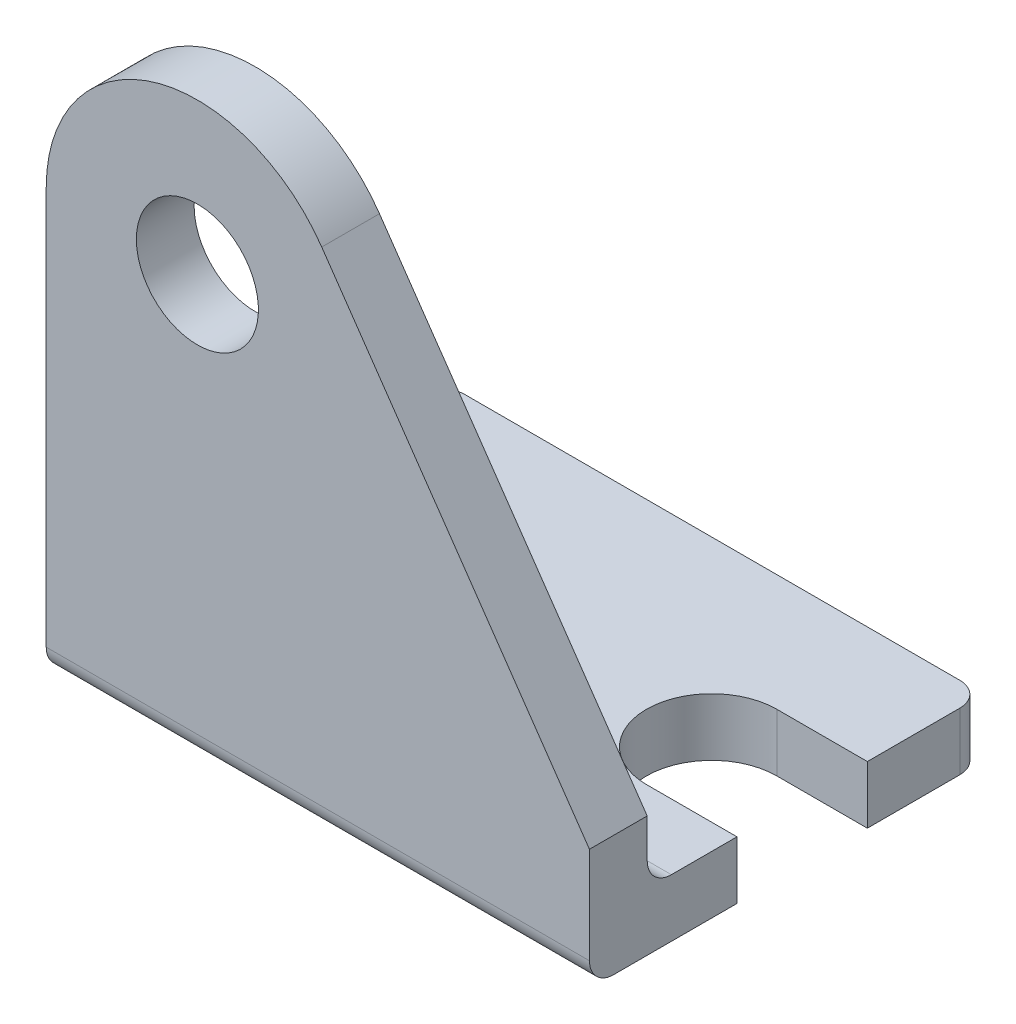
ISO-10303-21;
HEADER;
FILE_DESCRIPTION(('STEP AP214'),'2;1');
FILE_NAME('part.step','',(''),(''),'','','');
FILE_SCHEMA(('AUTOMOTIVE_DESIGN { 1 0 10303 214 1 1 1 1 }'));
ENDSEC;
DATA;
#1=APPLICATION_CONTEXT('core data for automotive mechanical design processes');
#2=APPLICATION_PROTOCOL_DEFINITION('international standard','automotive_design',2000,#1);
#3=PRODUCT_CONTEXT('',#1,'mechanical');
#4=PRODUCT('Part','Part','',(#3));
#5=PRODUCT_RELATED_PRODUCT_CATEGORY('part','',(#4));
#6=PRODUCT_DEFINITION_FORMATION('','',#4);
#7=PRODUCT_DEFINITION_CONTEXT('part definition',#1,'design');
#8=PRODUCT_DEFINITION('design','',#6,#7);
#9=PRODUCT_DEFINITION_SHAPE('','',#8);
#10=(LENGTH_UNIT() NAMED_UNIT(*) SI_UNIT(.MILLI.,.METRE.));
#11=(NAMED_UNIT(*) PLANE_ANGLE_UNIT() SI_UNIT($,.RADIAN.));
#12=(NAMED_UNIT(*) SI_UNIT($,.STERADIAN.) SOLID_ANGLE_UNIT());
#13=UNCERTAINTY_MEASURE_WITH_UNIT(LENGTH_MEASURE(1.E-05),#10,'distance_accuracy_value','');
#14=(GEOMETRIC_REPRESENTATION_CONTEXT(3) GLOBAL_UNCERTAINTY_ASSIGNED_CONTEXT((#13)) GLOBAL_UNIT_ASSIGNED_CONTEXT((#10,
#11,#12)) REPRESENTATION_CONTEXT('',''));
#15=CARTESIAN_POINT('',(0.,0.,0.));
#16=DIRECTION('',(0.,0.,1.));
#17=DIRECTION('',(1.,0.,0.));
#18=AXIS2_PLACEMENT_3D('',#15,#16,#17);
#19=CARTESIAN_POINT('',(4.7625,3.03784,-14.6177));
#20=DIRECTION('',(0.,0.,1.));
#21=DIRECTION('',(1.,0.,0.));
#22=AXIS2_PLACEMENT_3D('',#19,#20,#21);
#23=PLANE('',#22);
#24=DIRECTION('',(1.,0.,0.));
#25=VECTOR('',#24,1.);
#26=CARTESIAN_POINT('',(28.575,3.03784,-14.6177));
#27=LINE('',#26,#25);
#28=CARTESIAN_POINT('',(4.7625,3.03784,-14.6177));
#29=VERTEX_POINT('',#28);
#30=CARTESIAN_POINT('',(0.,3.03784,-14.6177));
#31=VERTEX_POINT('',#30);
#32=EDGE_CURVE('E248',#29,#31,#27,.F.);
#33=ORIENTED_EDGE('',*,*,#32,.T.);
#34=DIRECTION('',(0.,1.,0.));
#35=VECTOR('',#34,1.);
#36=CARTESIAN_POINT('',(0.,1.27000000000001,-14.6177));
#37=LINE('',#36,#35);
#38=CARTESIAN_POINT('',(0.,0.,-14.6177));
#39=VERTEX_POINT('',#38);
#40=EDGE_CURVE('E183',#31,#39,#37,.F.);
#41=ORIENTED_EDGE('',*,*,#40,.T.);
#42=DIRECTION('',(1.,0.,0.));
#43=VECTOR('',#42,1.);
#44=CARTESIAN_POINT('',(28.575,0.,-14.6177));
#45=LINE('',#44,#43);
#46=CARTESIAN_POINT('',(4.7625,0.,-14.6177));
#47=VERTEX_POINT('',#46);
#48=EDGE_CURVE('E240',#39,#47,#45,.T.);
#49=ORIENTED_EDGE('',*,*,#48,.T.);
#50=DIRECTION('',(0.,1.,0.));
#51=VECTOR('',#50,1.);
#52=CARTESIAN_POINT('',(4.7625,3.03784,-14.6177));
#53=LINE('',#52,#51);
#54=EDGE_CURVE('E182',#47,#29,#53,.T.);
#55=ORIENTED_EDGE('',*,*,#54,.T.);
#56=EDGE_LOOP('',(#33,#41,#49,#55));
#57=FACE_BOUND('',#56,.T.);
#58=ADVANCED_FACE('F17',(#57),#23,.T.);
#59=CARTESIAN_POINT('',(23.8125,3.03784,-11.1887));
#60=DIRECTION('',(0.,1.,0.));
#61=DIRECTION('',(0.,0.,1.));
#62=AXIS2_PLACEMENT_3D('',#59,#60,#61);
#63=CYLINDRICAL_SURFACE('',#62,3.429);
#64=DIRECTION('',(0.,1.,0.));
#65=VECTOR('',#64,1.);
#66=CARTESIAN_POINT('',(23.8125,3.03784,-7.7597));
#67=LINE('',#66,#65);
#68=CARTESIAN_POINT('',(23.8125,0.,-7.7597));
#69=VERTEX_POINT('',#68);
#70=CARTESIAN_POINT('',(23.8125,3.03784,-7.7597));
#71=VERTEX_POINT('',#70);
#72=EDGE_CURVE('E157',#69,#71,#67,.T.);
#73=ORIENTED_EDGE('',*,*,#72,.F.);
#74=CARTESIAN_POINT('',(23.8125,0.,-11.1887));
#75=DIRECTION('',(0.,1.,0.));
#76=DIRECTION('',(0.,0.,1.));
#77=AXIS2_PLACEMENT_3D('',#74,#75,#76);
#78=CIRCLE('',#77,3.429);
#79=CARTESIAN_POINT('',(23.8125,0.,-14.6177));
#80=VERTEX_POINT('',#79);
#81=EDGE_CURVE('E234',#69,#80,#78,.F.);
#82=ORIENTED_EDGE('',*,*,#81,.T.);
#83=DIRECTION('',(0.,1.,0.));
#84=VECTOR('',#83,1.);
#85=CARTESIAN_POINT('',(23.8125,3.03784,-14.6177));
#86=LINE('',#85,#84);
#87=CARTESIAN_POINT('',(23.8125,3.03784,-14.6177));
#88=VERTEX_POINT('',#87);
#89=EDGE_CURVE('E145',#88,#80,#86,.F.);
#90=ORIENTED_EDGE('',*,*,#89,.F.);
#91=CARTESIAN_POINT('',(23.8125,3.03784,-11.1887));
#92=DIRECTION('',(0.,1.,0.));
#93=DIRECTION('',(0.,0.,1.));
#94=AXIS2_PLACEMENT_3D('',#91,#92,#93);
#95=CIRCLE('',#94,3.429);
#96=EDGE_CURVE('E153',#88,#71,#95,.T.);
#97=ORIENTED_EDGE('',*,*,#96,.T.);
#98=EDGE_LOOP('',(#73,#82,#90,#97));
#99=FACE_BOUND('',#98,.T.);
#100=ADVANCED_FACE('F436',(#99),#63,.F.);
#101=CARTESIAN_POINT('',(28.575,3.03784,-14.6177));
#102=DIRECTION('',(0.,0.,1.));
#103=DIRECTION('',(1.,0.,0.));
#104=AXIS2_PLACEMENT_3D('',#101,#102,#103);
#105=PLANE('',#104);
#106=DIRECTION('',(1.,0.,0.));
#107=VECTOR('',#106,1.);
#108=CARTESIAN_POINT('',(28.575,3.03784,-14.6177));
#109=LINE('',#108,#107);
#110=CARTESIAN_POINT('',(28.575,3.03784,-14.6177));
#111=VERTEX_POINT('',#110);
#112=EDGE_CURVE('E141',#111,#88,#109,.F.);
#113=ORIENTED_EDGE('',*,*,#112,.T.);
#114=ORIENTED_EDGE('',*,*,#89,.T.);
#115=DIRECTION('',(1.,0.,0.));
#116=VECTOR('',#115,1.);
#117=CARTESIAN_POINT('',(28.575,0.,-14.6177));
#118=LINE('',#117,#116);
#119=CARTESIAN_POINT('',(28.575,0.,-14.6177));
#120=VERTEX_POINT('',#119);
#121=EDGE_CURVE('E143',#80,#120,#118,.T.);
#122=ORIENTED_EDGE('',*,*,#121,.T.);
#123=DIRECTION('',(0.,1.,0.));
#124=VECTOR('',#123,1.);
#125=CARTESIAN_POINT('',(28.575,1.27000000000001,-14.6177));
#126=LINE('',#125,#124);
#127=EDGE_CURVE('E138',#111,#120,#126,.F.);
#128=ORIENTED_EDGE('',*,*,#127,.F.);
#129=EDGE_LOOP('',(#113,#114,#122,#128));
#130=FACE_BOUND('',#129,.T.);
#131=ADVANCED_FACE('F140',(#130),#105,.T.);
#132=CARTESIAN_POINT('',(28.575,1.27000000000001,-1.27));
#133=DIRECTION('',(1.,0.,0.));
#134=DIRECTION('',(0.,0.,-1.));
#135=AXIS2_PLACEMENT_3D('',#132,#133,#134);
#136=PLANE('',#135);
#137=DIRECTION('',(0.,0.,-1.));
#138=VECTOR('',#137,1.);
#139=CARTESIAN_POINT('',(28.575,3.03784,-20.7518));
#140=LINE('',#139,#138);
#141=CARTESIAN_POINT('',(28.575,3.03784,-19.4818));
#142=VERTEX_POINT('',#141);
#143=EDGE_CURVE('E150',#142,#111,#140,.F.);
#144=ORIENTED_EDGE('',*,*,#143,.T.);
#145=ORIENTED_EDGE('',*,*,#127,.T.);
#146=DIRECTION('',(0.,0.,1.));
#147=VECTOR('',#146,1.);
#148=CARTESIAN_POINT('',(28.575,0.,-1.27));
#149=LINE('',#148,#147);
#150=CARTESIAN_POINT('',(28.575,0.,-19.4818));
#151=VERTEX_POINT('',#150);
#152=EDGE_CURVE('E233',#120,#151,#149,.F.);
#153=ORIENTED_EDGE('',*,*,#152,.T.);
#154=DIRECTION('',(0.,1.,0.));
#155=VECTOR('',#154,1.);
#156=CARTESIAN_POINT('',(28.575,3.03784,-19.4818));
#157=LINE('',#156,#155);
#158=EDGE_CURVE('E132',#142,#151,#157,.F.);
#159=ORIENTED_EDGE('',*,*,#158,.F.);
#160=EDGE_LOOP('',(#144,#145,#153,#159));
#161=FACE_BOUND('',#160,.T.);
#162=ADVANCED_FACE('F155',(#161),#136,.T.);
#163=CARTESIAN_POINT('',(27.305,3.03784,-19.4818));
#164=DIRECTION('',(0.,1.,0.));
#165=DIRECTION('',(0.,0.,1.));
#166=AXIS2_PLACEMENT_3D('',#163,#164,#165);
#167=CYLINDRICAL_SURFACE('',#166,1.27000000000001);
#168=CARTESIAN_POINT('',(27.305,3.03784,-19.4818));
#169=DIRECTION('',(0.,1.,0.));
#170=DIRECTION('',(0.,0.,1.));
#171=AXIS2_PLACEMENT_3D('',#168,#169,#170);
#172=CIRCLE('',#171,1.27000000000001);
#173=CARTESIAN_POINT('',(27.305,3.03784,-20.7518));
#174=VERTEX_POINT('',#173);
#175=EDGE_CURVE('E20',#174,#142,#172,.F.);
#176=ORIENTED_EDGE('',*,*,#175,.T.);
#177=ORIENTED_EDGE('',*,*,#158,.T.);
#178=CARTESIAN_POINT('',(27.305,0.,-19.4818));
#179=DIRECTION('',(0.,1.,0.));
#180=DIRECTION('',(0.,0.,1.));
#181=AXIS2_PLACEMENT_3D('',#178,#179,#180);
#182=CIRCLE('',#181,1.27000000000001);
#183=CARTESIAN_POINT('',(27.305,0.,-20.7518));
#184=VERTEX_POINT('',#183);
#185=EDGE_CURVE('E230',#151,#184,#182,.T.);
#186=ORIENTED_EDGE('',*,*,#185,.T.);
#187=DIRECTION('',(0.,1.,0.));
#188=VECTOR('',#187,1.);
#189=CARTESIAN_POINT('',(27.305,0.,-20.7518));
#190=LINE('',#189,#188);
#191=EDGE_CURVE('E190',#184,#174,#190,.T.);
#192=ORIENTED_EDGE('',*,*,#191,.T.);
#193=EDGE_LOOP('',(#176,#177,#186,#192));
#194=FACE_BOUND('',#193,.T.);
#195=ADVANCED_FACE('F428',(#194),#167,.T.);
#196=CARTESIAN_POINT('',(28.575,0.,-20.7518));
#197=DIRECTION('',(0.,0.,1.));
#198=DIRECTION('',(1.,0.,0.));
#199=AXIS2_PLACEMENT_3D('',#196,#197,#198);
#200=PLANE('',#199);
#201=DIRECTION('',(0.,1.,0.));
#202=VECTOR('',#201,1.);
#203=CARTESIAN_POINT('',(1.27,3.03784,-20.7518));
#204=LINE('',#203,#202);
#205=CARTESIAN_POINT('',(1.27,3.03784,-20.7518));
#206=VERTEX_POINT('',#205);
#207=CARTESIAN_POINT('',(1.27,0.,-20.7518));
#208=VERTEX_POINT('',#207);
#209=EDGE_CURVE('E186',#206,#208,#204,.F.);
#210=ORIENTED_EDGE('',*,*,#209,.F.);
#211=DIRECTION('',(1.,0.,0.));
#212=VECTOR('',#211,1.);
#213=CARTESIAN_POINT('',(28.575,3.03784,-20.7518));
#214=LINE('',#213,#212);
#215=EDGE_CURVE('E244',#206,#174,#214,.T.);
#216=ORIENTED_EDGE('',*,*,#215,.T.);
#217=ORIENTED_EDGE('',*,*,#191,.F.);
#218=DIRECTION('',(1.,0.,0.));
#219=VECTOR('',#218,1.);
#220=CARTESIAN_POINT('',(28.575,0.,-20.7518));
#221=LINE('',#220,#219);
#222=EDGE_CURVE('E229',#184,#208,#221,.F.);
#223=ORIENTED_EDGE('',*,*,#222,.T.);
#224=EDGE_LOOP('',(#210,#216,#217,#223));
#225=FACE_BOUND('',#224,.T.);
#226=ADVANCED_FACE('F424',(#225),#200,.F.);
#227=CARTESIAN_POINT('',(1.27,3.03784,-19.4818));
#228=DIRECTION('',(0.,1.,0.));
#229=DIRECTION('',(0.,0.,1.));
#230=AXIS2_PLACEMENT_3D('',#227,#228,#229);
#231=CYLINDRICAL_SURFACE('',#230,1.27);
#232=CARTESIAN_POINT('',(1.27,3.03784,-19.4818));
#233=DIRECTION('',(0.,1.,0.));
#234=DIRECTION('',(0.,0.,1.));
#235=AXIS2_PLACEMENT_3D('',#232,#233,#234);
#236=CIRCLE('',#235,1.27);
#237=CARTESIAN_POINT('',(0.,3.03784,-19.4818));
#238=VERTEX_POINT('',#237);
#239=EDGE_CURVE('E241',#238,#206,#236,.F.);
#240=ORIENTED_EDGE('',*,*,#239,.T.);
#241=ORIENTED_EDGE('',*,*,#209,.T.);
#242=CARTESIAN_POINT('',(1.27,0.,-19.4818));
#243=DIRECTION('',(0.,1.,0.));
#244=DIRECTION('',(0.,0.,1.));
#245=AXIS2_PLACEMENT_3D('',#242,#243,#244);
#246=CIRCLE('',#245,1.27);
#247=CARTESIAN_POINT('',(0.,0.,-19.4818));
#248=VERTEX_POINT('',#247);
#249=EDGE_CURVE('E225',#208,#248,#246,.T.);
#250=ORIENTED_EDGE('',*,*,#249,.T.);
#251=DIRECTION('',(0.,1.,0.));
#252=VECTOR('',#251,1.);
#253=CARTESIAN_POINT('',(0.,1.27000000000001,-19.4818));
#254=LINE('',#253,#252);
#255=EDGE_CURVE('E180',#248,#238,#254,.T.);
#256=ORIENTED_EDGE('',*,*,#255,.T.);
#257=EDGE_LOOP('',(#240,#241,#250,#256));
#258=FACE_BOUND('',#257,.T.);
#259=ADVANCED_FACE('F420',(#258),#231,.T.);
#260=CARTESIAN_POINT('',(0.,1.27000000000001,-1.27));
#261=DIRECTION('',(1.,0.,0.));
#262=DIRECTION('',(0.,0.,-1.));
#263=AXIS2_PLACEMENT_3D('',#260,#261,#262);
#264=PLANE('',#263);
#265=DIRECTION('',(0.,0.,1.));
#266=VECTOR('',#265,1.);
#267=CARTESIAN_POINT('',(0.,0.,-1.27));
#268=LINE('',#267,#266);
#269=EDGE_CURVE('E228',#248,#39,#268,.T.);
#270=ORIENTED_EDGE('',*,*,#269,.T.);
#271=ORIENTED_EDGE('',*,*,#40,.F.);
#272=DIRECTION('',(0.,0.,-1.));
#273=VECTOR('',#272,1.);
#274=CARTESIAN_POINT('',(0.,3.03784,-20.7518));
#275=LINE('',#274,#273);
#276=EDGE_CURVE('E245',#31,#238,#275,.T.);
#277=ORIENTED_EDGE('',*,*,#276,.T.);
#278=ORIENTED_EDGE('',*,*,#255,.F.);
#279=EDGE_LOOP('',(#270,#271,#277,#278));
#280=FACE_BOUND('',#279,.T.);
#281=ADVANCED_FACE('F416',(#280),#264,.F.);
#282=CARTESIAN_POINT('',(4.7625,3.03784,-11.1887));
#283=DIRECTION('',(0.,1.,0.));
#284=DIRECTION('',(0.,0.,1.));
#285=AXIS2_PLACEMENT_3D('',#282,#283,#284);
#286=CYLINDRICAL_SURFACE('',#285,3.429);
#287=DIRECTION('',(0.,1.,0.));
#288=VECTOR('',#287,1.);
#289=CARTESIAN_POINT('',(4.7625,3.03784,-7.7597));
#290=LINE('',#289,#288);
#291=CARTESIAN_POINT('',(4.7625,3.03784,-7.7597));
#292=VERTEX_POINT('',#291);
#293=CARTESIAN_POINT('',(4.7625,0.,-7.7597));
#294=VERTEX_POINT('',#293);
#295=EDGE_CURVE('E166',#292,#294,#290,.F.);
#296=ORIENTED_EDGE('',*,*,#295,.F.);
#297=CARTESIAN_POINT('',(4.7625,3.03784,-11.1887));
#298=DIRECTION('',(0.,1.,0.));
#299=DIRECTION('',(0.,0.,1.));
#300=AXIS2_PLACEMENT_3D('',#297,#298,#299);
#301=CIRCLE('',#300,3.429);
#302=EDGE_CURVE('E246',#292,#29,#301,.T.);
#303=ORIENTED_EDGE('',*,*,#302,.T.);
#304=ORIENTED_EDGE('',*,*,#54,.F.);
#305=CARTESIAN_POINT('',(4.7625,0.,-11.1887));
#306=DIRECTION('',(0.,1.,0.));
#307=DIRECTION('',(0.,0.,1.));
#308=AXIS2_PLACEMENT_3D('',#305,#306,#307);
#309=CIRCLE('',#308,3.429);
#310=EDGE_CURVE('E238',#47,#294,#309,.F.);
#311=ORIENTED_EDGE('',*,*,#310,.T.);
#312=EDGE_LOOP('',(#296,#303,#304,#311));
#313=FACE_BOUND('',#312,.T.);
#314=ADVANCED_FACE('F413',(#313),#286,.F.);
#315=CARTESIAN_POINT('',(23.8125,3.03784,-7.7597));
#316=DIRECTION('',(0.,0.,-1.));
#317=DIRECTION('',(-1.,0.,0.));
#318=AXIS2_PLACEMENT_3D('',#315,#316,#317);
#319=PLANE('',#318);
#320=DIRECTION('',(1.,0.,0.));
#321=VECTOR('',#320,1.);
#322=CARTESIAN_POINT('',(28.575,3.03784,-7.7597));
#323=LINE('',#322,#321);
#324=CARTESIAN_POINT('',(28.575,3.03784,-7.7597));
#325=VERTEX_POINT('',#324);
#326=EDGE_CURVE('E249',#71,#325,#323,.T.);
#327=ORIENTED_EDGE('',*,*,#326,.T.);
#328=DIRECTION('',(0.,1.,0.));
#329=VECTOR('',#328,1.);
#330=CARTESIAN_POINT('',(28.575,1.27000000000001,-7.7597));
#331=LINE('',#330,#329);
#332=CARTESIAN_POINT('',(28.575,0.,-7.7597));
#333=VERTEX_POINT('',#332);
#334=EDGE_CURVE('E170',#333,#325,#331,.T.);
#335=ORIENTED_EDGE('',*,*,#334,.F.);
#336=DIRECTION('',(1.,0.,0.));
#337=VECTOR('',#336,1.);
#338=CARTESIAN_POINT('',(28.575,0.,-7.7597));
#339=LINE('',#338,#337);
#340=EDGE_CURVE('E237',#333,#69,#339,.F.);
#341=ORIENTED_EDGE('',*,*,#340,.T.);
#342=ORIENTED_EDGE('',*,*,#72,.T.);
#343=EDGE_LOOP('',(#327,#335,#341,#342));
#344=FACE_BOUND('',#343,.T.);
#345=ADVANCED_FACE('F410',(#344),#319,.T.);
#346=CARTESIAN_POINT('',(28.575,3.03784,-20.7518));
#347=DIRECTION('',(0.,-1.,0.));
#348=DIRECTION('',(0.,0.,-1.));
#349=AXIS2_PLACEMENT_3D('',#346,#347,#348);
#350=PLANE('',#349);
#351=ORIENTED_EDGE('',*,*,#239,.F.);
#352=ORIENTED_EDGE('',*,*,#276,.F.);
#353=ORIENTED_EDGE('',*,*,#32,.F.);
#354=ORIENTED_EDGE('',*,*,#302,.F.);
#355=DIRECTION('',(-1.,0.,0.));
#356=VECTOR('',#355,1.);
#357=CARTESIAN_POINT('',(0.,3.03784,-7.7597));
#358=LINE('',#357,#356);
#359=CARTESIAN_POINT('',(0.,3.03784,-7.7597));
#360=VERTEX_POINT('',#359);
#361=EDGE_CURVE('E163',#360,#292,#358,.F.);
#362=ORIENTED_EDGE('',*,*,#361,.F.);
#363=DIRECTION('',(0.,0.,-1.));
#364=VECTOR('',#363,1.);
#365=CARTESIAN_POINT('',(0.,3.03784,-1.27));
#366=LINE('',#365,#364);
#367=CARTESIAN_POINT('',(0.,3.03784,-4.30784));
#368=VERTEX_POINT('',#367);
#369=EDGE_CURVE('E214',#360,#368,#366,.F.);
#370=ORIENTED_EDGE('',*,*,#369,.T.);
#371=DIRECTION('',(1.,0.,0.));
#372=VECTOR('',#371,1.);
#373=CARTESIAN_POINT('',(28.575,3.03784,-4.30784));
#374=LINE('',#373,#372);
#375=CARTESIAN_POINT('',(28.575,3.03784,-4.30784));
#376=VERTEX_POINT('',#375);
#377=EDGE_CURVE('E269',#368,#376,#374,.T.);
#378=ORIENTED_EDGE('',*,*,#377,.T.);
#379=DIRECTION('',(0.,0.,-1.));
#380=VECTOR('',#379,1.);
#381=CARTESIAN_POINT('',(28.575,3.03784,-1.27));
#382=LINE('',#381,#380);
#383=EDGE_CURVE('E173',#325,#376,#382,.F.);
#384=ORIENTED_EDGE('',*,*,#383,.F.);
#385=ORIENTED_EDGE('',*,*,#326,.F.);
#386=ORIENTED_EDGE('',*,*,#96,.F.);
#387=ORIENTED_EDGE('',*,*,#112,.F.);
#388=ORIENTED_EDGE('',*,*,#143,.F.);
#389=ORIENTED_EDGE('',*,*,#175,.F.);
#390=ORIENTED_EDGE('',*,*,#215,.F.);
#391=EDGE_LOOP('',(#351,#352,#353,#354,#362,#370,#378,#384,#385,#386,#387,#388,#389,#390));
#392=FACE_BOUND('',#391,.T.);
#393=ADVANCED_FACE('F149',(#392),#350,.F.);
#394=CARTESIAN_POINT('',(28.575,4.30784,-4.30784));
#395=DIRECTION('',(1.,0.,0.));
#396=DIRECTION('',(0.,0.,-1.));
#397=AXIS2_PLACEMENT_3D('',#394,#395,#396);
#398=CYLINDRICAL_SURFACE('',#397,1.27);
#399=DIRECTION('',(1.,0.,0.));
#400=VECTOR('',#399,1.);
#401=CARTESIAN_POINT('',(28.575,4.30784,-3.03784));
#402=LINE('',#401,#400);
#403=CARTESIAN_POINT('',(0.,4.30784,-3.03784));
#404=VERTEX_POINT('',#403);
#405=CARTESIAN_POINT('',(28.575,4.30784,-3.03784));
#406=VERTEX_POINT('',#405);
#407=EDGE_CURVE('E179',#404,#406,#402,.T.);
#408=ORIENTED_EDGE('',*,*,#407,.T.);
#409=CARTESIAN_POINT('',(28.575,4.30784,-4.30784));
#410=DIRECTION('',(1.,0.,0.));
#411=DIRECTION('',(0.,0.,-1.));
#412=AXIS2_PLACEMENT_3D('',#409,#410,#411);
#413=CIRCLE('',#412,1.27);
#414=EDGE_CURVE('E218',#376,#406,#413,.F.);
#415=ORIENTED_EDGE('',*,*,#414,.F.);
#416=ORIENTED_EDGE('',*,*,#377,.F.);
#417=CARTESIAN_POINT('',(0.,4.30784,-4.30784));
#418=DIRECTION('',(1.,0.,0.));
#419=DIRECTION('',(0.,0.,-1.));
#420=AXIS2_PLACEMENT_3D('',#417,#418,#419);
#421=CIRCLE('',#420,1.27);
#422=EDGE_CURVE('E211',#368,#404,#421,.F.);
#423=ORIENTED_EDGE('',*,*,#422,.T.);
#424=EDGE_LOOP('',(#408,#415,#416,#423));
#425=FACE_BOUND('',#424,.T.);
#426=ADVANCED_FACE('F403',(#425),#398,.F.);
#427=CARTESIAN_POINT('',(28.575,0.,-1.27));
#428=DIRECTION('',(0.,1.,0.));
#429=DIRECTION('',(0.,0.,1.));
#430=AXIS2_PLACEMENT_3D('',#427,#428,#429);
#431=PLANE('',#430);
#432=ORIENTED_EDGE('',*,*,#249,.F.);
#433=ORIENTED_EDGE('',*,*,#222,.F.);
#434=ORIENTED_EDGE('',*,*,#185,.F.);
#435=ORIENTED_EDGE('',*,*,#152,.F.);
#436=ORIENTED_EDGE('',*,*,#121,.F.);
#437=ORIENTED_EDGE('',*,*,#81,.F.);
#438=ORIENTED_EDGE('',*,*,#340,.F.);
#439=DIRECTION('',(0.,0.,-1.));
#440=VECTOR('',#439,1.);
#441=CARTESIAN_POINT('',(28.575,0.,-1.27));
#442=LINE('',#441,#440);
#443=CARTESIAN_POINT('',(28.575,0.,-1.27));
#444=VERTEX_POINT('',#443);
#445=EDGE_CURVE('E174',#444,#333,#442,.T.);
#446=ORIENTED_EDGE('',*,*,#445,.F.);
#447=DIRECTION('',(1.,0.,0.));
#448=VECTOR('',#447,1.);
#449=CARTESIAN_POINT('',(28.575,0.,-1.27));
#450=LINE('',#449,#448);
#451=CARTESIAN_POINT('',(0.,0.,-1.27));
#452=VERTEX_POINT('',#451);
#453=EDGE_CURVE('E217',#452,#444,#450,.T.);
#454=ORIENTED_EDGE('',*,*,#453,.F.);
#455=DIRECTION('',(0.,0.,-1.));
#456=VECTOR('',#455,1.);
#457=CARTESIAN_POINT('',(0.,0.,-1.27));
#458=LINE('',#457,#456);
#459=CARTESIAN_POINT('',(0.,0.,-7.7597));
#460=VERTEX_POINT('',#459);
#461=EDGE_CURVE('E209',#452,#460,#458,.T.);
#462=ORIENTED_EDGE('',*,*,#461,.T.);
#463=DIRECTION('',(-1.,0.,0.));
#464=VECTOR('',#463,1.);
#465=CARTESIAN_POINT('',(0.,0.,-7.7597));
#466=LINE('',#465,#464);
#467=EDGE_CURVE('E167',#294,#460,#466,.T.);
#468=ORIENTED_EDGE('',*,*,#467,.F.);
#469=ORIENTED_EDGE('',*,*,#310,.F.);
#470=ORIENTED_EDGE('',*,*,#48,.F.);
#471=ORIENTED_EDGE('',*,*,#269,.F.);
#472=EDGE_LOOP('',(#432,#433,#434,#435,#436,#437,#438,#446,#454,#462,#468,#469,#470,#471));
#473=FACE_BOUND('',#472,.T.);
#474=ADVANCED_FACE('F399',(#473),#431,.F.);
#475=CARTESIAN_POINT('',(0.,3.03784,-7.7597));
#476=DIRECTION('',(0.,0.,-1.));
#477=DIRECTION('',(-1.,0.,0.));
#478=AXIS2_PLACEMENT_3D('',#475,#476,#477);
#479=PLANE('',#478);
#480=ORIENTED_EDGE('',*,*,#361,.T.);
#481=ORIENTED_EDGE('',*,*,#295,.T.);
#482=ORIENTED_EDGE('',*,*,#467,.T.);
#483=DIRECTION('',(0.,1.,0.));
#484=VECTOR('',#483,1.);
#485=CARTESIAN_POINT('',(0.,1.27000000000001,-7.7597));
#486=LINE('',#485,#484);
#487=EDGE_CURVE('E205',#460,#360,#486,.T.);
#488=ORIENTED_EDGE('',*,*,#487,.T.);
#489=EDGE_LOOP('',(#480,#481,#482,#488));
#490=FACE_BOUND('',#489,.T.);
#491=ADVANCED_FACE('F395',(#490),#479,.T.);
#492=CARTESIAN_POINT('',(28.575,4.30784,-3.03784));
#493=DIRECTION('',(0.,0.,1.));
#494=DIRECTION('',(1.,0.,0.));
#495=AXIS2_PLACEMENT_3D('',#492,#493,#494);
#496=PLANE('',#495);
#497=DIRECTION('',(-0.568252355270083,0.822854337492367,0.));
#498=VECTOR('',#497,1.);
#499=CARTESIAN_POINT('',(28.575,6.35,-3.03784));
#500=LINE('',#499,#498);
#501=CARTESIAN_POINT('',(28.575,6.35,-3.03784));
#502=VERTEX_POINT('',#501);
#503=CARTESIAN_POINT('',(14.4920565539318,26.7427198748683,-3.03784));
#504=VERTEX_POINT('',#503);
#505=EDGE_CURVE('E224',#502,#504,#500,.T.);
#506=ORIENTED_EDGE('',*,*,#505,.F.);
#507=DIRECTION('',(0.,1.,0.));
#508=VECTOR('',#507,1.);
#509=CARTESIAN_POINT('',(28.575,1.27000000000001,-3.03784));
#510=LINE('',#509,#508);
#511=EDGE_CURVE('E220',#406,#502,#510,.T.);
#512=ORIENTED_EDGE('',*,*,#511,.F.);
#513=ORIENTED_EDGE('',*,*,#407,.F.);
#514=DIRECTION('',(0.,1.,0.));
#515=VECTOR('',#514,1.);
#516=CARTESIAN_POINT('',(0.,1.27000000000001,-3.03784));
#517=LINE('',#516,#515);
#518=CARTESIAN_POINT('',(0.,22.225,-3.03784));
#519=VERTEX_POINT('',#518);
#520=EDGE_CURVE('E210',#404,#519,#517,.T.);
#521=ORIENTED_EDGE('',*,*,#520,.T.);
#522=CARTESIAN_POINT('',(7.9502,22.225,-3.03784));
#523=DIRECTION('',(0.,0.,-1.));
#524=DIRECTION('',(-1.,0.,0.));
#525=AXIS2_PLACEMENT_3D('',#522,#523,#524);
#526=CIRCLE('',#525,7.9502);
#527=EDGE_CURVE('E203',#504,#519,#526,.F.);
#528=ORIENTED_EDGE('',*,*,#527,.F.);
#529=EDGE_LOOP('',(#506,#512,#513,#521,#528));
#530=FACE_BOUND('',#529,.T.);
#531=CARTESIAN_POINT('',(7.9502,22.225,-3.03784));
#532=DIRECTION('',(0.,0.,-1.));
#533=DIRECTION('',(-1.,0.,0.));
#534=AXIS2_PLACEMENT_3D('',#531,#532,#533);
#535=CIRCLE('',#534,3.209925);
#536=CARTESIAN_POINT('',(4.740275,22.225,-3.03784));
#537=VERTEX_POINT('',#536);
#538=EDGE_CURVE('E221',#537,#537,#535,.F.);
#539=ORIENTED_EDGE('',*,*,#538,.T.);
#540=EDGE_LOOP('',(#539));
#541=FACE_BOUND('',#540,.T.);
#542=ADVANCED_FACE('F391',(#530,#541),#496,.F.);
#543=CARTESIAN_POINT('',(7.9502,22.225,-3.03784));
#544=DIRECTION('',(0.,0.,-1.));
#545=DIRECTION('',(-1.,0.,0.));
#546=AXIS2_PLACEMENT_3D('',#543,#544,#545);
#547=CYLINDRICAL_SURFACE('',#546,3.209925);
#548=CARTESIAN_POINT('',(7.9502,22.225,0.));
#549=DIRECTION('',(0.,0.,-1.));
#550=DIRECTION('',(-1.,0.,0.));
#551=AXIS2_PLACEMENT_3D('',#548,#549,#550);
#552=CIRCLE('',#551,3.209925);
#553=CARTESIAN_POINT('',(4.740275,22.225,0.));
#554=VERTEX_POINT('',#553);
#555=EDGE_CURVE('E198',#554,#554,#552,.F.);
#556=ORIENTED_EDGE('',*,*,#555,.T.);
#557=EDGE_LOOP('',(#556));
#558=FACE_BOUND('',#557,.T.);
#559=ORIENTED_EDGE('',*,*,#538,.F.);
#560=EDGE_LOOP('',(#559));
#561=FACE_BOUND('',#560,.T.);
#562=ADVANCED_FACE('F388',(#558,#561),#547,.F.);
#563=CARTESIAN_POINT('',(28.575,6.35,-20.7518));
#564=DIRECTION('',(0.822854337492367,0.568252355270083,0.));
#565=DIRECTION('',(-0.568252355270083,0.822854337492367,0.));
#566=AXIS2_PLACEMENT_3D('',#563,#564,#565);
#567=PLANE('',#566);
#568=DIRECTION('',(0.568252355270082,-0.822854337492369,0.));
#569=VECTOR('',#568,1.);
#570=CARTESIAN_POINT('',(14.4920565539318,26.7427198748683,0.));
#571=LINE('',#570,#569);
#572=CARTESIAN_POINT('',(14.4920565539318,26.7427198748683,0.));
#573=VERTEX_POINT('',#572);
#574=CARTESIAN_POINT('',(28.575,6.35,0.));
#575=VERTEX_POINT('',#574);
#576=EDGE_CURVE('E201',#573,#575,#571,.T.);
#577=ORIENTED_EDGE('',*,*,#576,.T.);
#578=DIRECTION('',(0.,0.,-1.));
#579=VECTOR('',#578,1.);
#580=CARTESIAN_POINT('',(28.575,6.35,-1.27));
#581=LINE('',#580,#579);
#582=EDGE_CURVE('E275',#502,#575,#581,.F.);
#583=ORIENTED_EDGE('',*,*,#582,.F.);
#584=ORIENTED_EDGE('',*,*,#505,.T.);
#585=DIRECTION('',(0.,0.,-1.));
#586=VECTOR('',#585,1.);
#587=CARTESIAN_POINT('',(14.4920565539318,26.7427198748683,-20.7518));
#588=LINE('',#587,#586);
#589=EDGE_CURVE('E202',#573,#504,#588,.T.);
#590=ORIENTED_EDGE('',*,*,#589,.F.);
#591=EDGE_LOOP('',(#577,#583,#584,#590));
#592=FACE_BOUND('',#591,.T.);
#593=ADVANCED_FACE('F368',(#592),#567,.T.);
#594=CARTESIAN_POINT('',(28.575,1.27000000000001,-1.27));
#595=DIRECTION('',(1.,0.,0.));
#596=DIRECTION('',(0.,0.,-1.));
#597=AXIS2_PLACEMENT_3D('',#594,#595,#596);
#598=PLANE('',#597);
#599=DIRECTION('',(0.,1.,0.));
#600=VECTOR('',#599,1.);
#601=CARTESIAN_POINT('',(28.575,30.226,0.));
#602=LINE('',#601,#600);
#603=CARTESIAN_POINT('',(28.575,1.27000000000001,0.));
#604=VERTEX_POINT('',#603);
#605=EDGE_CURVE('E324',#575,#604,#602,.F.);
#606=ORIENTED_EDGE('',*,*,#605,.T.);
#607=CARTESIAN_POINT('',(28.575,1.27000000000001,-1.27));
#608=DIRECTION('',(1.,0.,0.));
#609=DIRECTION('',(0.,0.,-1.));
#610=AXIS2_PLACEMENT_3D('',#607,#608,#609);
#611=CIRCLE('',#610,1.27);
#612=EDGE_CURVE('E215',#444,#604,#611,.F.);
#613=ORIENTED_EDGE('',*,*,#612,.F.);
#614=ORIENTED_EDGE('',*,*,#445,.T.);
#615=ORIENTED_EDGE('',*,*,#334,.T.);
#616=ORIENTED_EDGE('',*,*,#383,.T.);
#617=ORIENTED_EDGE('',*,*,#414,.T.);
#618=ORIENTED_EDGE('',*,*,#511,.T.);
#619=ORIENTED_EDGE('',*,*,#582,.T.);
#620=EDGE_LOOP('',(#606,#613,#614,#615,#616,#617,#618,#619));
#621=FACE_BOUND('',#620,.T.);
#622=ADVANCED_FACE('F363',(#621),#598,.T.);
#623=CARTESIAN_POINT('',(28.575,1.27000000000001,-1.27));
#624=DIRECTION('',(1.,0.,0.));
#625=DIRECTION('',(0.,0.,-1.));
#626=AXIS2_PLACEMENT_3D('',#623,#624,#625);
#627=CYLINDRICAL_SURFACE('',#626,1.27);
#628=ORIENTED_EDGE('',*,*,#612,.T.);
#629=DIRECTION('',(-1.,0.,0.));
#630=VECTOR('',#629,1.);
#631=CARTESIAN_POINT('',(28.575,1.27000000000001,0.));
#632=LINE('',#631,#630);
#633=CARTESIAN_POINT('',(0.,1.27000000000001,0.));
#634=VERTEX_POINT('',#633);
#635=EDGE_CURVE('E327',#604,#634,#632,.T.);
#636=ORIENTED_EDGE('',*,*,#635,.T.);
#637=CARTESIAN_POINT('',(0.,1.27000000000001,-1.27));
#638=DIRECTION('',(1.,0.,0.));
#639=DIRECTION('',(0.,0.,-1.));
#640=AXIS2_PLACEMENT_3D('',#637,#638,#639);
#641=CIRCLE('',#640,1.27);
#642=EDGE_CURVE('E206',#634,#452,#641,.T.);
#643=ORIENTED_EDGE('',*,*,#642,.T.);
#644=ORIENTED_EDGE('',*,*,#453,.T.);
#645=EDGE_LOOP('',(#628,#636,#643,#644));
#646=FACE_BOUND('',#645,.T.);
#647=ADVANCED_FACE('F359',(#646),#627,.T.);
#648=CARTESIAN_POINT('',(0.,1.27000000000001,-1.27));
#649=DIRECTION('',(1.,0.,0.));
#650=DIRECTION('',(0.,0.,-1.));
#651=AXIS2_PLACEMENT_3D('',#648,#649,#650);
#652=PLANE('',#651);
#653=ORIENTED_EDGE('',*,*,#461,.F.);
#654=ORIENTED_EDGE('',*,*,#642,.F.);
#655=DIRECTION('',(0.,1.,0.));
#656=VECTOR('',#655,1.);
#657=CARTESIAN_POINT('',(0.,30.226,0.));
#658=LINE('',#657,#656);
#659=CARTESIAN_POINT('',(0.,22.225,0.));
#660=VERTEX_POINT('',#659);
#661=EDGE_CURVE('E26',#634,#660,#658,.T.);
#662=ORIENTED_EDGE('',*,*,#661,.T.);
#663=DIRECTION('',(0.,0.,-1.));
#664=VECTOR('',#663,1.);
#665=CARTESIAN_POINT('',(0.,22.225,-20.7518));
#666=LINE('',#665,#664);
#667=EDGE_CURVE('E34',#519,#660,#666,.F.);
#668=ORIENTED_EDGE('',*,*,#667,.F.);
#669=ORIENTED_EDGE('',*,*,#520,.F.);
#670=ORIENTED_EDGE('',*,*,#422,.F.);
#671=ORIENTED_EDGE('',*,*,#369,.F.);
#672=ORIENTED_EDGE('',*,*,#487,.F.);
#673=EDGE_LOOP('',(#653,#654,#662,#668,#669,#670,#671,#672));
#674=FACE_BOUND('',#673,.T.);
#675=ADVANCED_FACE('F351',(#674),#652,.F.);
#676=CARTESIAN_POINT('',(7.9502,22.225,-20.7518));
#677=DIRECTION('',(0.,0.,-1.));
#678=DIRECTION('',(-1.,0.,0.));
#679=AXIS2_PLACEMENT_3D('',#676,#677,#678);
#680=CYLINDRICAL_SURFACE('',#679,7.9502);
#681=CARTESIAN_POINT('',(7.9502,22.225,0.));
#682=DIRECTION('',(0.,0.,-1.));
#683=DIRECTION('',(-1.,0.,0.));
#684=AXIS2_PLACEMENT_3D('',#681,#682,#683);
#685=CIRCLE('',#684,7.9502);
#686=EDGE_CURVE('E11',#660,#573,#685,.T.);
#687=ORIENTED_EDGE('',*,*,#686,.T.);
#688=ORIENTED_EDGE('',*,*,#589,.T.);
#689=ORIENTED_EDGE('',*,*,#527,.T.);
#690=ORIENTED_EDGE('',*,*,#667,.T.);
#691=EDGE_LOOP('',(#687,#688,#689,#690));
#692=FACE_BOUND('',#691,.T.);
#693=ADVANCED_FACE('F371',(#692),#680,.T.);
#694=CARTESIAN_POINT('',(28.575,30.226,0.));
#695=DIRECTION('',(0.,0.,-1.));
#696=DIRECTION('',(-1.,0.,0.));
#697=AXIS2_PLACEMENT_3D('',#694,#695,#696);
#698=PLANE('',#697);
#699=ORIENTED_EDGE('',*,*,#661,.F.);
#700=ORIENTED_EDGE('',*,*,#635,.F.);
#701=ORIENTED_EDGE('',*,*,#605,.F.);
#702=ORIENTED_EDGE('',*,*,#576,.F.);
#703=ORIENTED_EDGE('',*,*,#686,.F.);
#704=EDGE_LOOP('',(#699,#700,#701,#702,#703));
#705=FACE_BOUND('',#704,.T.);
#706=ORIENTED_EDGE('',*,*,#555,.F.);
#707=EDGE_LOOP('',(#706));
#708=FACE_BOUND('',#707,.T.);
#709=ADVANCED_FACE('F355',(#705,#708),#698,.F.);
#710=CLOSED_SHELL('',(#58,#100,#131,#162,#195,#226,#259,#281,#314,#345,#393,#426,#474,#491,#542,
#562,#593,#622,#647,#675,#693,#709));
#711=MANIFOLD_SOLID_BREP('B1',#710);
#712=ADVANCED_BREP_SHAPE_REPRESENTATION('',(#18,#711),#14);
#713=SHAPE_DEFINITION_REPRESENTATION(#9,#712);
ENDSEC;
END-ISO-10303-21;
